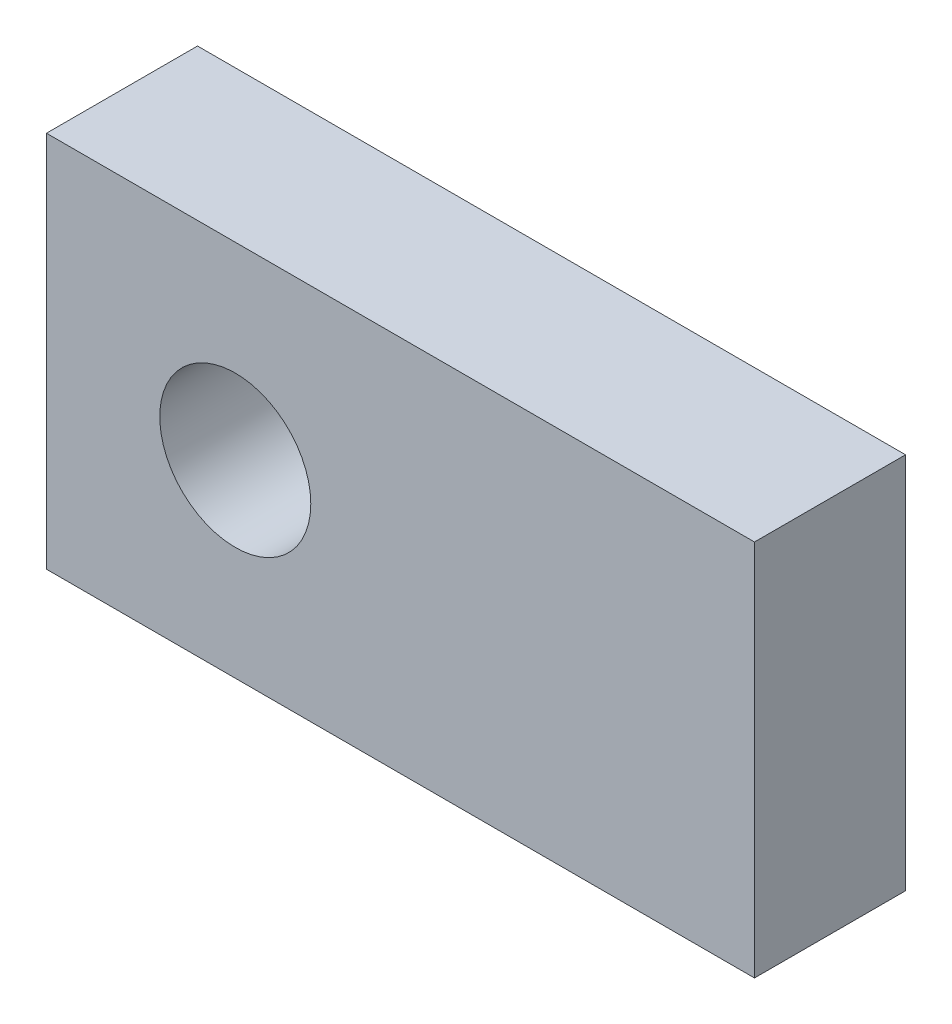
ISO-10303-21;
HEADER;
FILE_DESCRIPTION(('STEP AP214'),'2;1');
FILE_NAME('part.step','',(''),(''),'','','');
FILE_SCHEMA(('AUTOMOTIVE_DESIGN { 1 0 10303 214 1 1 1 1 }'));
ENDSEC;
DATA;
#1=APPLICATION_CONTEXT('core data for automotive mechanical design processes');
#2=APPLICATION_PROTOCOL_DEFINITION('international standard','automotive_design',2000,#1);
#3=PRODUCT_CONTEXT('',#1,'mechanical');
#4=PRODUCT('Part','Part','',(#3));
#5=PRODUCT_RELATED_PRODUCT_CATEGORY('part','',(#4));
#6=PRODUCT_DEFINITION_FORMATION('','',#4);
#7=PRODUCT_DEFINITION_CONTEXT('part definition',#1,'design');
#8=PRODUCT_DEFINITION('design','',#6,#7);
#9=PRODUCT_DEFINITION_SHAPE('','',#8);
#10=(LENGTH_UNIT() NAMED_UNIT(*) SI_UNIT(.MILLI.,.METRE.));
#11=(NAMED_UNIT(*) PLANE_ANGLE_UNIT() SI_UNIT($,.RADIAN.));
#12=(NAMED_UNIT(*) SI_UNIT($,.STERADIAN.) SOLID_ANGLE_UNIT());
#13=UNCERTAINTY_MEASURE_WITH_UNIT(LENGTH_MEASURE(1.E-05),#10,'distance_accuracy_value','');
#14=(GEOMETRIC_REPRESENTATION_CONTEXT(3) GLOBAL_UNCERTAINTY_ASSIGNED_CONTEXT((#13)) GLOBAL_UNIT_ASSIGNED_CONTEXT((#10,
#11,#12)) REPRESENTATION_CONTEXT('',''));
#15=CARTESIAN_POINT('',(0.,0.,0.));
#16=DIRECTION('',(0.,0.,1.));
#17=DIRECTION('',(1.,0.,0.));
#18=AXIS2_PLACEMENT_3D('',#15,#16,#17);
#19=CARTESIAN_POINT('',(55.,20.,0.));
#20=DIRECTION('',(-1.,0.,0.));
#21=DIRECTION('',(0.,-1.,0.));
#22=AXIS2_PLACEMENT_3D('',#19,#20,#21);
#23=PLANE('',#22);
#24=DIRECTION('',(0.,0.,-1.));
#25=VECTOR('',#24,1.);
#26=CARTESIAN_POINT('',(55.,-20.,0.));
#27=LINE('',#26,#25);
#28=CARTESIAN_POINT('',(55.,-20.,16.));
#29=VERTEX_POINT('',#28);
#30=CARTESIAN_POINT('',(55.,-20.,0.));
#31=VERTEX_POINT('',#30);
#32=EDGE_CURVE('E151',#29,#31,#27,.T.);
#33=ORIENTED_EDGE('',*,*,#32,.T.);
#34=DIRECTION('',(0.,-1.,0.));
#35=VECTOR('',#34,1.);
#36=CARTESIAN_POINT('',(55.,20.,0.));
#37=LINE('',#36,#35);
#38=CARTESIAN_POINT('',(55.,20.,0.));
#39=VERTEX_POINT('',#38);
#40=EDGE_CURVE('E9',#39,#31,#37,.T.);
#41=ORIENTED_EDGE('',*,*,#40,.F.);
#42=DIRECTION('',(0.,0.,-1.));
#43=VECTOR('',#42,1.);
#44=CARTESIAN_POINT('',(55.,20.,0.));
#45=LINE('',#44,#43);
#46=CARTESIAN_POINT('',(55.,20.,16.));
#47=VERTEX_POINT('',#46);
#48=EDGE_CURVE('E160',#47,#39,#45,.T.);
#49=ORIENTED_EDGE('',*,*,#48,.F.);
#50=DIRECTION('',(0.,-1.,0.));
#51=VECTOR('',#50,1.);
#52=CARTESIAN_POINT('',(55.,20.,16.));
#53=LINE('',#52,#51);
#54=EDGE_CURVE('E167',#47,#29,#53,.T.);
#55=ORIENTED_EDGE('',*,*,#54,.T.);
#56=EDGE_LOOP('',(#33,#41,#49,#55));
#57=FACE_BOUND('',#56,.T.);
#58=ADVANCED_FACE('F14',(#57),#23,.F.);
#59=CARTESIAN_POINT('',(55.,20.,0.));
#60=DIRECTION('',(0.,0.,1.));
#61=DIRECTION('',(0.,1.,0.));
#62=AXIS2_PLACEMENT_3D('',#59,#60,#61);
#63=PLANE('',#62);
#64=CARTESIAN_POINT('',(10.802605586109,6.28917423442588,0.));
#65=DIRECTION('',(0.,0.,-1.));
#66=DIRECTION('',(0.,-1.,0.));
#67=AXIS2_PLACEMENT_3D('',#64,#65,#66);
#68=CIRCLE('',#67,2.5);
#69=CARTESIAN_POINT('',(9.45935656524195,8.3976528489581,0.));
#70=VERTEX_POINT('',#69);
#71=CARTESIAN_POINT('',(12.9631267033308,7.54700908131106,0.));
#72=VERTEX_POINT('',#71);
#73=EDGE_CURVE('E107',#70,#72,#68,.T.);
#74=ORIENTED_EDGE('',*,*,#73,.F.);
#75=DIRECTION('',(0.843391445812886,0.537299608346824,0.));
#76=VECTOR('',#75,1.);
#77=CARTESIAN_POINT('',(5.45828283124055,5.84868776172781,0.));
#78=LINE('',#77,#76);
#79=CARTESIAN_POINT('',(5.45828283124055,5.84868776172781,0.));
#80=VERTEX_POINT('',#79);
#81=EDGE_CURVE('E124',#80,#70,#78,.T.);
#82=ORIENTED_EDGE('',*,*,#81,.F.);
#83=CARTESIAN_POINT('',(0.,0.,0.));
#84=DIRECTION('',(0.,0.,1.));
#85=DIRECTION('',(1.,0.,0.));
#86=AXIS2_PLACEMENT_3D('',#83,#84,#85);
#87=CIRCLE('',#86,8.);
#88=CARTESIAN_POINT('',(5.45828283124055,-5.84868776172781,0.));
#89=VERTEX_POINT('',#88);
#90=EDGE_CURVE('E148',#80,#89,#87,.T.);
#91=ORIENTED_EDGE('',*,*,#90,.T.);
#92=DIRECTION('',(-0.843391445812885,0.537299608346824,0.));
#93=VECTOR('',#92,1.);
#94=CARTESIAN_POINT('',(5.45828283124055,-5.84868776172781,0.));
#95=LINE('',#94,#93);
#96=CARTESIAN_POINT('',(9.45935656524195,-8.3976528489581,0.));
#97=VERTEX_POINT('',#96);
#98=EDGE_CURVE('E120',#97,#89,#95,.T.);
#99=ORIENTED_EDGE('',*,*,#98,.F.);
#100=CARTESIAN_POINT('',(10.802605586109,-6.28917423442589,0.));
#101=DIRECTION('',(0.,0.,-1.));
#102=DIRECTION('',(0.,-1.,0.));
#103=AXIS2_PLACEMENT_3D('',#100,#101,#102);
#104=CIRCLE('',#103,2.5);
#105=CARTESIAN_POINT('',(12.9631267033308,-7.54700908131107,0.));
#106=VERTEX_POINT('',#105);
#107=EDGE_CURVE('E118',#106,#97,#104,.T.);
#108=ORIENTED_EDGE('',*,*,#107,.F.);
#109=CARTESIAN_POINT('',(0.,0.,0.));
#110=DIRECTION('',(0.,0.,-1.));
#111=DIRECTION('',(0.,-1.,0.));
#112=AXIS2_PLACEMENT_3D('',#109,#110,#111);
#113=CIRCLE('',#112,15.);
#114=EDGE_CURVE('E96',#72,#106,#113,.T.);
#115=ORIENTED_EDGE('',*,*,#114,.F.);
#116=EDGE_LOOP('',(#74,#82,#91,#99,#108,#115));
#117=FACE_BOUND('',#116,.T.);
#118=DIRECTION('',(-1.,0.,0.));
#119=VECTOR('',#118,1.);
#120=CARTESIAN_POINT('',(55.,-20.,0.));
#121=LINE('',#120,#119);
#122=CARTESIAN_POINT('',(-20.,-20.,0.));
#123=VERTEX_POINT('',#122);
#124=EDGE_CURVE('E154',#31,#123,#121,.T.);
#125=ORIENTED_EDGE('',*,*,#124,.T.);
#126=DIRECTION('',(0.,-1.,0.));
#127=VECTOR('',#126,1.);
#128=CARTESIAN_POINT('',(-20.,20.,0.));
#129=LINE('',#128,#127);
#130=CARTESIAN_POINT('',(-20.,20.,0.));
#131=VERTEX_POINT('',#130);
#132=EDGE_CURVE('E21',#131,#123,#129,.T.);
#133=ORIENTED_EDGE('',*,*,#132,.F.);
#134=DIRECTION('',(-1.,0.,0.));
#135=VECTOR('',#134,1.);
#136=CARTESIAN_POINT('',(55.,20.,0.));
#137=LINE('',#136,#135);
#138=EDGE_CURVE('E162',#39,#131,#137,.T.);
#139=ORIENTED_EDGE('',*,*,#138,.F.);
#140=ORIENTED_EDGE('',*,*,#40,.T.);
#141=EDGE_LOOP('',(#125,#133,#139,#140));
#142=FACE_BOUND('',#141,.T.);
#143=ADVANCED_FACE('F114',(#117,#142),#63,.F.);
#144=CARTESIAN_POINT('',(-20.,20.,0.));
#145=DIRECTION('',(1.,0.,0.));
#146=DIRECTION('',(0.,1.,0.));
#147=AXIS2_PLACEMENT_3D('',#144,#145,#146);
#148=PLANE('',#147);
#149=DIRECTION('',(0.,0.,1.));
#150=VECTOR('',#149,1.);
#151=CARTESIAN_POINT('',(-20.,-20.,0.));
#152=LINE('',#151,#150);
#153=CARTESIAN_POINT('',(-20.,-20.,16.));
#154=VERTEX_POINT('',#153);
#155=EDGE_CURVE('E156',#123,#154,#152,.T.);
#156=ORIENTED_EDGE('',*,*,#155,.T.);
#157=DIRECTION('',(0.,-1.,0.));
#158=VECTOR('',#157,1.);
#159=CARTESIAN_POINT('',(-20.,20.,16.));
#160=LINE('',#159,#158);
#161=CARTESIAN_POINT('',(-20.,20.,16.));
#162=VERTEX_POINT('',#161);
#163=EDGE_CURVE('E170',#162,#154,#160,.T.);
#164=ORIENTED_EDGE('',*,*,#163,.F.);
#165=DIRECTION('',(0.,0.,1.));
#166=VECTOR('',#165,1.);
#167=CARTESIAN_POINT('',(-20.,20.,0.));
#168=LINE('',#167,#166);
#169=EDGE_CURVE('E164',#131,#162,#168,.T.);
#170=ORIENTED_EDGE('',*,*,#169,.F.);
#171=ORIENTED_EDGE('',*,*,#132,.T.);
#172=EDGE_LOOP('',(#156,#164,#170,#171));
#173=FACE_BOUND('',#172,.T.);
#174=ADVANCED_FACE('F177',(#173),#148,.F.);
#175=CARTESIAN_POINT('',(-20.,20.,16.));
#176=DIRECTION('',(0.,0.,-1.));
#177=DIRECTION('',(-1.,0.,0.));
#178=AXIS2_PLACEMENT_3D('',#175,#176,#177);
#179=PLANE('',#178);
#180=CARTESIAN_POINT('',(0.,0.,16.));
#181=DIRECTION('',(0.,0.,1.));
#182=DIRECTION('',(1.,0.,0.));
#183=AXIS2_PLACEMENT_3D('',#180,#181,#182);
#184=CIRCLE('',#183,8.);
#185=CARTESIAN_POINT('',(8.,0.,16.));
#186=VERTEX_POINT('',#185);
#187=EDGE_CURVE('E137',#186,#186,#184,.T.);
#188=ORIENTED_EDGE('',*,*,#187,.F.);
#189=EDGE_LOOP('',(#188));
#190=FACE_BOUND('',#189,.T.);
#191=DIRECTION('',(1.,0.,0.));
#192=VECTOR('',#191,1.);
#193=CARTESIAN_POINT('',(-20.,-20.,16.));
#194=LINE('',#193,#192);
#195=EDGE_CURVE('E158',#154,#29,#194,.T.);
#196=ORIENTED_EDGE('',*,*,#195,.T.);
#197=ORIENTED_EDGE('',*,*,#54,.F.);
#198=DIRECTION('',(1.,0.,0.));
#199=VECTOR('',#198,1.);
#200=CARTESIAN_POINT('',(-20.,20.,16.));
#201=LINE('',#200,#199);
#202=EDGE_CURVE('E36',#162,#47,#201,.T.);
#203=ORIENTED_EDGE('',*,*,#202,.F.);
#204=ORIENTED_EDGE('',*,*,#163,.T.);
#205=EDGE_LOOP('',(#196,#197,#203,#204));
#206=FACE_BOUND('',#205,.T.);
#207=ADVANCED_FACE('F184',(#190,#206),#179,.F.);
#208=CARTESIAN_POINT('',(55.,20.,0.));
#209=DIRECTION('',(0.,-1.,0.));
#210=DIRECTION('',(1.,0.,0.));
#211=AXIS2_PLACEMENT_3D('',#208,#209,#210);
#212=PLANE('',#211);
#213=ORIENTED_EDGE('',*,*,#48,.T.);
#214=ORIENTED_EDGE('',*,*,#138,.T.);
#215=ORIENTED_EDGE('',*,*,#169,.T.);
#216=ORIENTED_EDGE('',*,*,#202,.T.);
#217=EDGE_LOOP('',(#213,#214,#215,#216));
#218=FACE_BOUND('',#217,.T.);
#219=ADVANCED_FACE('F188',(#218),#212,.F.);
#220=CARTESIAN_POINT('',(55.,-20.,0.));
#221=DIRECTION('',(0.,-1.,0.));
#222=DIRECTION('',(1.,0.,0.));
#223=AXIS2_PLACEMENT_3D('',#220,#221,#222);
#224=PLANE('',#223);
#225=ORIENTED_EDGE('',*,*,#32,.F.);
#226=ORIENTED_EDGE('',*,*,#195,.F.);
#227=ORIENTED_EDGE('',*,*,#155,.F.);
#228=ORIENTED_EDGE('',*,*,#124,.F.);
#229=EDGE_LOOP('',(#225,#226,#227,#228));
#230=FACE_BOUND('',#229,.T.);
#231=ADVANCED_FACE('F182',(#230),#224,.T.);
#232=CARTESIAN_POINT('',(0.,0.,0.));
#233=DIRECTION('',(0.,0.,1.));
#234=DIRECTION('',(1.,0.,0.));
#235=AXIS2_PLACEMENT_3D('',#232,#233,#234);
#236=CYLINDRICAL_SURFACE('',#235,8.);
#237=ORIENTED_EDGE('',*,*,#90,.F.);
#238=DIRECTION('',(0.,0.,-1.));
#239=VECTOR('',#238,1.);
#240=CARTESIAN_POINT('',(5.45828283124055,5.84868776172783,6.));
#241=LINE('',#240,#239);
#242=CARTESIAN_POINT('',(5.45828283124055,5.84868776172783,6.));
#243=VERTEX_POINT('',#242);
#244=EDGE_CURVE('E138',#243,#80,#241,.T.);
#245=ORIENTED_EDGE('',*,*,#244,.F.);
#246=CARTESIAN_POINT('',(0.,0.,6.));
#247=DIRECTION('',(0.,0.,1.));
#248=DIRECTION('',(0.,-1.,0.));
#249=AXIS2_PLACEMENT_3D('',#246,#247,#248);
#250=CIRCLE('',#249,8.);
#251=CARTESIAN_POINT('',(5.45828283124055,-5.84868776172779,6.));
#252=VERTEX_POINT('',#251);
#253=EDGE_CURVE('E132',#252,#243,#250,.T.);
#254=ORIENTED_EDGE('',*,*,#253,.F.);
#255=DIRECTION('',(0.,0.,-1.));
#256=VECTOR('',#255,1.);
#257=CARTESIAN_POINT('',(5.45828283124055,-5.84868776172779,6.));
#258=LINE('',#257,#256);
#259=EDGE_CURVE('E140',#252,#89,#258,.T.);
#260=ORIENTED_EDGE('',*,*,#259,.T.);
#261=EDGE_LOOP('',(#237,#245,#254,#260));
#262=FACE_BOUND('',#261,.T.);
#263=ORIENTED_EDGE('',*,*,#187,.T.);
#264=EDGE_LOOP('',(#263));
#265=FACE_BOUND('',#264,.T.);
#266=ADVANCED_FACE('F205',(#262,#265),#236,.F.);
#267=CARTESIAN_POINT('',(10.802605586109,6.2891742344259,6.));
#268=DIRECTION('',(0.,0.,-1.));
#269=DIRECTION('',(0.,-1.,0.));
#270=AXIS2_PLACEMENT_3D('',#267,#268,#269);
#271=CYLINDRICAL_SURFACE('',#270,2.5);
#272=ORIENTED_EDGE('',*,*,#73,.T.);
#273=DIRECTION('',(0.,0.,-1.));
#274=VECTOR('',#273,1.);
#275=CARTESIAN_POINT('',(12.9631267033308,7.54700908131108,6.));
#276=LINE('',#275,#274);
#277=CARTESIAN_POINT('',(12.9631267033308,7.54700908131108,6.));
#278=VERTEX_POINT('',#277);
#279=EDGE_CURVE('E92',#278,#72,#276,.T.);
#280=ORIENTED_EDGE('',*,*,#279,.F.);
#281=CARTESIAN_POINT('',(10.802605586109,6.2891742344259,6.));
#282=DIRECTION('',(0.,0.,-1.));
#283=DIRECTION('',(0.,-1.,0.));
#284=AXIS2_PLACEMENT_3D('',#281,#282,#283);
#285=CIRCLE('',#284,2.5);
#286=CARTESIAN_POINT('',(9.45935656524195,8.39765284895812,6.));
#287=VERTEX_POINT('',#286);
#288=EDGE_CURVE('E126',#287,#278,#285,.T.);
#289=ORIENTED_EDGE('',*,*,#288,.F.);
#290=DIRECTION('',(0.,0.,-1.));
#291=VECTOR('',#290,1.);
#292=CARTESIAN_POINT('',(9.45935656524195,8.39765284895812,6.));
#293=LINE('',#292,#291);
#294=EDGE_CURVE('E109',#287,#70,#293,.T.);
#295=ORIENTED_EDGE('',*,*,#294,.T.);
#296=EDGE_LOOP('',(#272,#280,#289,#295));
#297=FACE_BOUND('',#296,.T.);
#298=ADVANCED_FACE('F108',(#297),#271,.F.);
#299=CARTESIAN_POINT('',(5.45828283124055,5.84868776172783,6.));
#300=DIRECTION('',(-0.537299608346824,0.843391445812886,0.));
#301=DIRECTION('',(-0.843391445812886,-0.537299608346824,0.));
#302=AXIS2_PLACEMENT_3D('',#299,#300,#301);
#303=PLANE('',#302);
#304=ORIENTED_EDGE('',*,*,#81,.T.);
#305=ORIENTED_EDGE('',*,*,#294,.F.);
#306=DIRECTION('',(0.843391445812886,0.537299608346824,0.));
#307=VECTOR('',#306,1.);
#308=CARTESIAN_POINT('',(5.45828283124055,5.84868776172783,6.));
#309=LINE('',#308,#307);
#310=EDGE_CURVE('E104',#243,#287,#309,.T.);
#311=ORIENTED_EDGE('',*,*,#310,.F.);
#312=ORIENTED_EDGE('',*,*,#244,.T.);
#313=EDGE_LOOP('',(#304,#305,#311,#312));
#314=FACE_BOUND('',#313,.T.);
#315=ADVANCED_FACE('F211',(#314),#303,.F.);
#316=CARTESIAN_POINT('',(5.45828283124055,-5.84868776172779,6.));
#317=DIRECTION('',(-0.537299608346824,-0.843391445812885,0.));
#318=DIRECTION('',(0.843391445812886,-0.537299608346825,0.));
#319=AXIS2_PLACEMENT_3D('',#316,#317,#318);
#320=PLANE('',#319);
#321=ORIENTED_EDGE('',*,*,#98,.T.);
#322=ORIENTED_EDGE('',*,*,#259,.F.);
#323=DIRECTION('',(-0.843391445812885,0.537299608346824,0.));
#324=VECTOR('',#323,1.);
#325=CARTESIAN_POINT('',(5.45828283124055,-5.84868776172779,6.));
#326=LINE('',#325,#324);
#327=CARTESIAN_POINT('',(9.45935656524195,-8.39765284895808,6.));
#328=VERTEX_POINT('',#327);
#329=EDGE_CURVE('E28',#328,#252,#326,.T.);
#330=ORIENTED_EDGE('',*,*,#329,.F.);
#331=DIRECTION('',(0.,0.,-1.));
#332=VECTOR('',#331,1.);
#333=CARTESIAN_POINT('',(9.45935656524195,-8.39765284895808,6.));
#334=LINE('',#333,#332);
#335=EDGE_CURVE('E143',#328,#97,#334,.T.);
#336=ORIENTED_EDGE('',*,*,#335,.T.);
#337=EDGE_LOOP('',(#321,#322,#330,#336));
#338=FACE_BOUND('',#337,.T.);
#339=ADVANCED_FACE('F218',(#338),#320,.F.);
#340=CARTESIAN_POINT('',(10.802605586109,-6.28917423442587,6.));
#341=DIRECTION('',(0.,0.,-1.));
#342=DIRECTION('',(0.,-1.,0.));
#343=AXIS2_PLACEMENT_3D('',#340,#341,#342);
#344=CYLINDRICAL_SURFACE('',#343,2.5);
#345=ORIENTED_EDGE('',*,*,#107,.T.);
#346=ORIENTED_EDGE('',*,*,#335,.F.);
#347=CARTESIAN_POINT('',(10.802605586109,-6.28917423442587,6.));
#348=DIRECTION('',(0.,0.,-1.));
#349=DIRECTION('',(0.,-1.,0.));
#350=AXIS2_PLACEMENT_3D('',#347,#348,#349);
#351=CIRCLE('',#350,2.5);
#352=CARTESIAN_POINT('',(12.9631267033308,-7.54700908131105,6.));
#353=VERTEX_POINT('',#352);
#354=EDGE_CURVE('E129',#353,#328,#351,.T.);
#355=ORIENTED_EDGE('',*,*,#354,.F.);
#356=DIRECTION('',(0.,0.,-1.));
#357=VECTOR('',#356,1.);
#358=CARTESIAN_POINT('',(12.9631267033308,-7.54700908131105,6.));
#359=LINE('',#358,#357);
#360=EDGE_CURVE('E103',#353,#106,#359,.T.);
#361=ORIENTED_EDGE('',*,*,#360,.T.);
#362=EDGE_LOOP('',(#345,#346,#355,#361));
#363=FACE_BOUND('',#362,.T.);
#364=ADVANCED_FACE('F215',(#363),#344,.F.);
#365=CARTESIAN_POINT('',(0.,0.,6.));
#366=DIRECTION('',(0.,0.,-1.));
#367=DIRECTION('',(0.,-1.,0.));
#368=AXIS2_PLACEMENT_3D('',#365,#366,#367);
#369=CYLINDRICAL_SURFACE('',#368,15.);
#370=ORIENTED_EDGE('',*,*,#114,.T.);
#371=ORIENTED_EDGE('',*,*,#360,.F.);
#372=CARTESIAN_POINT('',(0.,0.,6.));
#373=DIRECTION('',(0.,0.,-1.));
#374=DIRECTION('',(0.,-1.,0.));
#375=AXIS2_PLACEMENT_3D('',#372,#373,#374);
#376=CIRCLE('',#375,15.);
#377=EDGE_CURVE('E99',#278,#353,#376,.T.);
#378=ORIENTED_EDGE('',*,*,#377,.F.);
#379=ORIENTED_EDGE('',*,*,#279,.T.);
#380=EDGE_LOOP('',(#370,#371,#378,#379));
#381=FACE_BOUND('',#380,.T.);
#382=ADVANCED_FACE('F94',(#381),#369,.F.);
#383=CARTESIAN_POINT('',(10.802605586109,6.2891742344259,6.));
#384=DIRECTION('',(0.,0.,-1.));
#385=DIRECTION('',(0.,-1.,0.));
#386=AXIS2_PLACEMENT_3D('',#383,#384,#385);
#387=PLANE('',#386);
#388=ORIENTED_EDGE('',*,*,#288,.T.);
#389=ORIENTED_EDGE('',*,*,#377,.T.);
#390=ORIENTED_EDGE('',*,*,#354,.T.);
#391=ORIENTED_EDGE('',*,*,#329,.T.);
#392=ORIENTED_EDGE('',*,*,#253,.T.);
#393=ORIENTED_EDGE('',*,*,#310,.T.);
#394=EDGE_LOOP('',(#388,#389,#390,#391,#392,#393));
#395=FACE_BOUND('',#394,.T.);
#396=ADVANCED_FACE('F214',(#395),#387,.T.);
#397=CLOSED_SHELL('',(#58,#143,#174,#207,#219,#231,#266,#298,#315,#339,#364,#382,#396));
#398=MANIFOLD_SOLID_BREP('B1',#397);
#399=ADVANCED_BREP_SHAPE_REPRESENTATION('',(#18,#398),#14);
#400=SHAPE_DEFINITION_REPRESENTATION(#9,#399);
ENDSEC;
END-ISO-10303-21;
